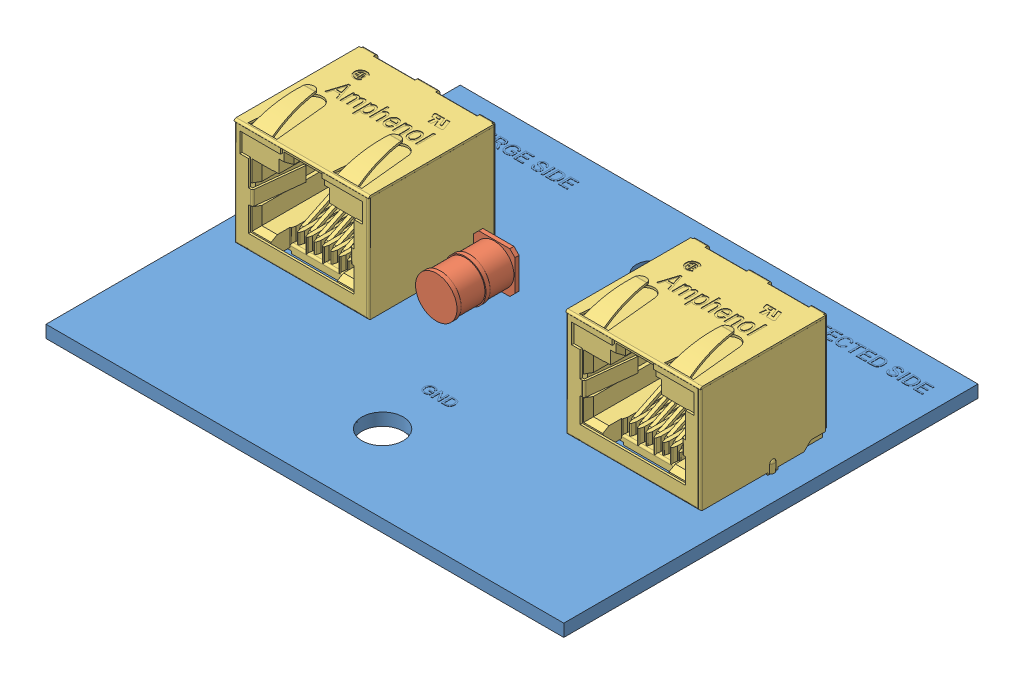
SolidWorks assembly 10-610107-100 Rev A.SLDASM, configuration Default (file format 10000). Lengths in mm.
Overall size (63.5 21.67 50.8).
7 component instances, 3 part files, 6 mates.
Components (placement in the parent):
- 12-610107-100 Rev A-1: 12-610107-100 Rev A.SLDPRT [Default] at (23.413 35.8857 53.2111) size (63.5 1.55 50.8)
- 15-600052-100 Rev A-1: 15-600052-100 Rev A.SLDPRT [Default] at (15.2599 39.9497 40.8835) x (0 1 0) z (1 0 0) size (5.08 7.62 5.08)
- 15-600052-100 Rev A-2: 15-600052-100 Rev A.SLDPRT [Default] at (14.7405 33.3457 31.5389) x (0 1 0) z (0 0 1) size (5.08 7.62 5.08)
- 15-600052-100 Rev A-3: 15-600052-100 Rev A.SLDPRT [Default] at (1.9318 39.9497 32.0435) x (0 1 0) z (0 0 1) size (5.08 7.62 5.08)
- 15-600052-100 Rev A-4: 15-600052-100 Rev A.SLDPRT [Default] at (6.5701 33.3457 59.122) x (0 1 0) z (0 0 1) size (5.08 7.62 5.08)
- 15-600029-100 Rev A-1: 15-600029-100 Rev A.SLDPRT [Default] at (3.1488 40.4809 45.9413) size (16.83 18.85 15.92)
- 15-600029-100 Rev A-2: 15-600029-100 Rev A.SLDPRT [Default] at (43.7845 40.4809 45.9009) size (16.83 18.85 15.92)
Mates (geometry in assembly coordinates):
- Coincident3: coincident anti-aligned: plane of 12-610107-100 Rev A-1 through (23.413 35.8857 53.2111) normal (0 -1 0); plane of 15-600052-100 Rev A-2 through (15.2485 35.8857 28.9989) normal (0 1 0)
- Coincident6: coincident anti-aligned: plane of 12-610107-100 Rev A-1 through (23.413 35.8857 53.2111) normal (0 -1 0); plane of 15-600052-100 Rev A-4 through (7.0781 35.8857 56.582) normal (0 1 0)
- Coincident7: coincident anti-aligned: plane of 12-610107-100 Rev A-1 through (23.413 37.4097 53.2111) normal (0 1 0); plane of 15-600029-100 Rev A-1 through (8.4199 37.4097 39.3369) normal (0 -1 0)
- Coincident8: coincident anti-aligned: plane of 12-610107-100 Rev A-1 through (23.413 37.4097 53.2111) normal (0 1 0); plane of 15-600029-100 Rev A-2 through (49.0556 37.4097 39.2966) normal (0 -1 0)
- Coincident9: coincident anti-aligned: plane of 12-610107-100 Rev A-1 through (23.413 37.4097 53.2111) normal (0 1 0); plane of 15-600052-100 Rev A-3 through (2.4398 37.4097 29.5035) normal (0 -1 0)
- Coincident10: coincident anti-aligned: plane of 12-610107-100 Rev A-1 through (23.413 37.4097 53.2111) normal (0 1 0); plane of 15-600052-100 Rev A-1 through (12.7199 37.4097 40.3755) normal (0 -1 0)
